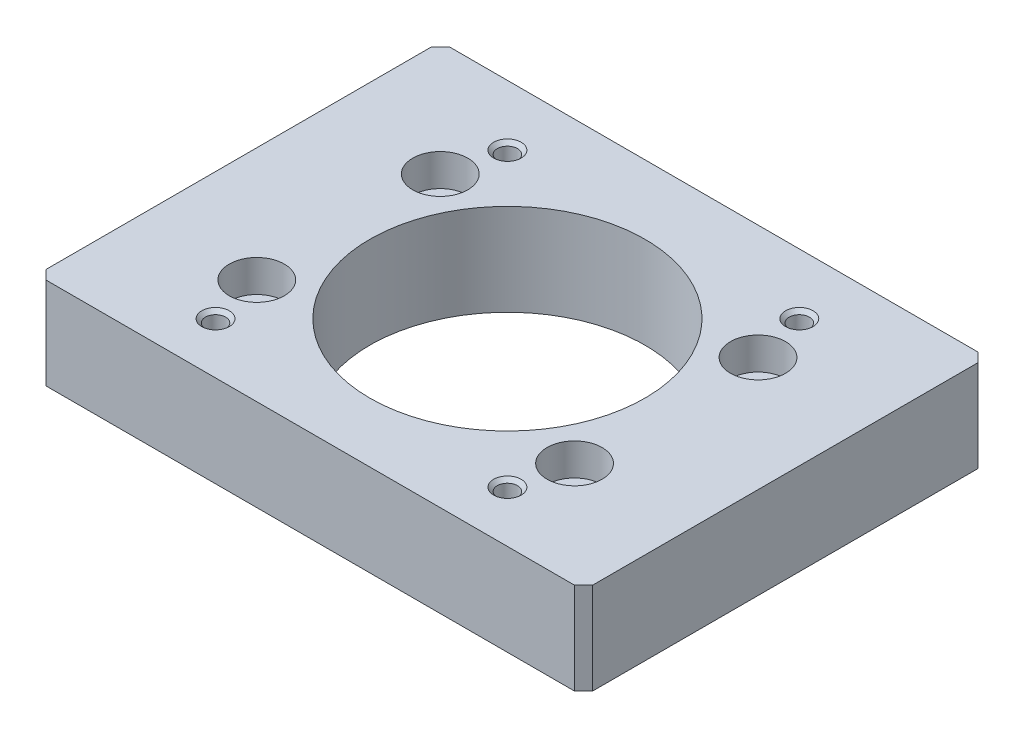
ISO-10303-21;
HEADER;
FILE_DESCRIPTION(('STEP AP214'),'2;1');
FILE_NAME('part.step','',(''),(''),'','','');
FILE_SCHEMA(('AUTOMOTIVE_DESIGN { 1 0 10303 214 1 1 1 1 }'));
ENDSEC;
DATA;
#1=APPLICATION_CONTEXT('core data for automotive mechanical design processes');
#2=APPLICATION_PROTOCOL_DEFINITION('international standard','automotive_design',2000,#1);
#3=PRODUCT_CONTEXT('',#1,'mechanical');
#4=PRODUCT('Part','Part','',(#3));
#5=PRODUCT_RELATED_PRODUCT_CATEGORY('part','',(#4));
#6=PRODUCT_DEFINITION_FORMATION('','',#4);
#7=PRODUCT_DEFINITION_CONTEXT('part definition',#1,'design');
#8=PRODUCT_DEFINITION('design','',#6,#7);
#9=PRODUCT_DEFINITION_SHAPE('','',#8);
#10=(LENGTH_UNIT() NAMED_UNIT(*) SI_UNIT(.MILLI.,.METRE.));
#11=(NAMED_UNIT(*) PLANE_ANGLE_UNIT() SI_UNIT($,.RADIAN.));
#12=(NAMED_UNIT(*) SI_UNIT($,.STERADIAN.) SOLID_ANGLE_UNIT());
#13=UNCERTAINTY_MEASURE_WITH_UNIT(LENGTH_MEASURE(1.E-05),#10,'distance_accuracy_value','');
#14=(GEOMETRIC_REPRESENTATION_CONTEXT(3) GLOBAL_UNCERTAINTY_ASSIGNED_CONTEXT((#13)) GLOBAL_UNIT_ASSIGNED_CONTEXT((#10,
#11,#12)) REPRESENTATION_CONTEXT('',''));
#15=CARTESIAN_POINT('',(0.,0.,0.));
#16=DIRECTION('',(0.,0.,1.));
#17=DIRECTION('',(1.,0.,0.));
#18=AXIS2_PLACEMENT_3D('',#15,#16,#17);
#19=CARTESIAN_POINT('',(-15.9099025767,9.60000000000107,-15.4099025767));
#20=DIRECTION('',(0.,1.,0.));
#21=DIRECTION('',(-1.,0.,0.));
#22=AXIS2_PLACEMENT_3D('',#19,#20,#21);
#23=CONICAL_SURFACE('',#22,1.09999999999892,0.785398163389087);
#24=CARTESIAN_POINT('',(-15.9099025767,9.6,-15.4099025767));
#25=DIRECTION('',(0.,1.,0.));
#26=DIRECTION('',(1.,0.,0.));
#27=AXIS2_PLACEMENT_3D('',#24,#25,#26);
#28=CIRCLE('',#27,1.1);
#29=CARTESIAN_POINT('',(-14.8099025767,9.6,-15.4099025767));
#30=VERTEX_POINT('',#29);
#31=EDGE_CURVE('E191',#30,#30,#28,.F.);
#32=ORIENTED_EDGE('',*,*,#31,.T.);
#33=EDGE_LOOP('',(#32));
#34=FACE_BOUND('',#33,.T.);
#35=CARTESIAN_POINT('',(-15.9099025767,10.0000000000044,-15.4099025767));
#36=DIRECTION('',(0.,1.,0.));
#37=DIRECTION('',(-1.,0.,0.));
#38=AXIS2_PLACEMENT_3D('',#35,#36,#37);
#39=CIRCLE('',#38,1.49999999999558);
#40=CARTESIAN_POINT('',(-17.4099025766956,10.0000000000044,-15.4099025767));
#41=VERTEX_POINT('',#40);
#42=EDGE_CURVE('E174',#41,#41,#39,.T.);
#43=ORIENTED_EDGE('',*,*,#42,.T.);
#44=EDGE_LOOP('',(#43));
#45=FACE_BOUND('',#44,.T.);
#46=ADVANCED_FACE('F16',(#34,#45),#23,.F.);
#47=CARTESIAN_POINT('',(15.9099025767,9.60000000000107,-15.4099025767));
#48=DIRECTION('',(0.,1.,0.));
#49=DIRECTION('',(0.,0.,1.));
#50=AXIS2_PLACEMENT_3D('',#47,#48,#49);
#51=CONICAL_SURFACE('',#50,1.09999999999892,0.785398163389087);
#52=CARTESIAN_POINT('',(15.9099025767,9.6,-15.4099025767));
#53=DIRECTION('',(0.,1.,0.));
#54=DIRECTION('',(1.,0.,0.));
#55=AXIS2_PLACEMENT_3D('',#52,#53,#54);
#56=CIRCLE('',#55,1.1);
#57=CARTESIAN_POINT('',(17.0099025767,9.6,-15.4099025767));
#58=VERTEX_POINT('',#57);
#59=EDGE_CURVE('E195',#58,#58,#56,.F.);
#60=ORIENTED_EDGE('',*,*,#59,.T.);
#61=EDGE_LOOP('',(#60));
#62=FACE_BOUND('',#61,.T.);
#63=CARTESIAN_POINT('',(15.9099025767,10.0000000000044,-15.4099025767));
#64=DIRECTION('',(0.,1.,0.));
#65=DIRECTION('',(0.,0.,1.));
#66=AXIS2_PLACEMENT_3D('',#63,#64,#65);
#67=CIRCLE('',#66,1.49999999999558);
#68=CARTESIAN_POINT('',(15.9099025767,10.0000000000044,-13.9099025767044));
#69=VERTEX_POINT('',#68);
#70=EDGE_CURVE('E171',#69,#69,#67,.T.);
#71=ORIENTED_EDGE('',*,*,#70,.T.);
#72=EDGE_LOOP('',(#71));
#73=FACE_BOUND('',#72,.T.);
#74=ADVANCED_FACE('F359',(#62,#73),#51,.F.);
#75=CARTESIAN_POINT('',(-15.9099025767,9.60000000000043,16.4099025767));
#76=DIRECTION('',(0.,1.,0.));
#77=DIRECTION('',(0.,0.,1.));
#78=AXIS2_PLACEMENT_3D('',#75,#76,#77);
#79=CONICAL_SURFACE('',#78,1.09999999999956,0.785398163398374);
#80=CARTESIAN_POINT('',(-15.9099025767,9.6,16.4099025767));
#81=DIRECTION('',(0.,1.,0.));
#82=DIRECTION('',(1.,0.,0.));
#83=AXIS2_PLACEMENT_3D('',#80,#81,#82);
#84=CIRCLE('',#83,1.1);
#85=CARTESIAN_POINT('',(-14.8099025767,9.6,16.4099025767));
#86=VERTEX_POINT('',#85);
#87=EDGE_CURVE('E208',#86,#86,#84,.F.);
#88=ORIENTED_EDGE('',*,*,#87,.T.);
#89=EDGE_LOOP('',(#88));
#90=FACE_BOUND('',#89,.T.);
#91=CARTESIAN_POINT('',(-15.9099025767,10.0000000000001,16.4099025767));
#92=DIRECTION('',(0.,1.,0.));
#93=DIRECTION('',(0.,0.,1.));
#94=AXIS2_PLACEMENT_3D('',#91,#92,#93);
#95=CIRCLE('',#94,1.49999999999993);
#96=CARTESIAN_POINT('',(-15.9099025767,10.0000000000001,17.9099025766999));
#97=VERTEX_POINT('',#96);
#98=EDGE_CURVE('E168',#97,#97,#95,.T.);
#99=ORIENTED_EDGE('',*,*,#98,.T.);
#100=EDGE_LOOP('',(#99));
#101=FACE_BOUND('',#100,.T.);
#102=ADVANCED_FACE('F355',(#90,#101),#79,.F.);
#103=CARTESIAN_POINT('',(15.9099025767,9.60000000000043,16.4099025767));
#104=DIRECTION('',(0.,1.,0.));
#105=DIRECTION('',(0.,0.,1.));
#106=AXIS2_PLACEMENT_3D('',#103,#104,#105);
#107=CONICAL_SURFACE('',#106,1.09999999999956,0.785398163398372);
#108=CARTESIAN_POINT('',(15.9099025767,9.6,16.4099025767));
#109=DIRECTION('',(0.,1.,0.));
#110=DIRECTION('',(1.,0.,0.));
#111=AXIS2_PLACEMENT_3D('',#108,#109,#110);
#112=CIRCLE('',#111,1.1);
#113=CARTESIAN_POINT('',(17.0099025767,9.6,16.4099025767));
#114=VERTEX_POINT('',#113);
#115=EDGE_CURVE('E200',#114,#114,#112,.F.);
#116=ORIENTED_EDGE('',*,*,#115,.T.);
#117=EDGE_LOOP('',(#116));
#118=FACE_BOUND('',#117,.T.);
#119=CARTESIAN_POINT('',(15.9099025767,10.0000000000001,16.4099025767));
#120=DIRECTION('',(0.,1.,0.));
#121=DIRECTION('',(0.,0.,1.));
#122=AXIS2_PLACEMENT_3D('',#119,#120,#121);
#123=CIRCLE('',#122,1.49999999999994);
#124=CARTESIAN_POINT('',(15.9099025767,10.0000000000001,17.9099025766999));
#125=VERTEX_POINT('',#124);
#126=EDGE_CURVE('E165',#125,#125,#123,.T.);
#127=ORIENTED_EDGE('',*,*,#126,.T.);
#128=EDGE_LOOP('',(#127));
#129=FACE_BOUND('',#128,.T.);
#130=ADVANCED_FACE('F352',(#118,#129),#107,.F.);
#131=CARTESIAN_POINT('',(17.32050807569,6.5,-9.5));
#132=DIRECTION('',(0.,1.,0.));
#133=DIRECTION('',(0.,0.,1.));
#134=AXIS2_PLACEMENT_3D('',#131,#132,#133);
#135=CYLINDRICAL_SURFACE('',#134,3.);
#136=CARTESIAN_POINT('',(17.32050807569,6.5,-9.5));
#137=DIRECTION('',(0.,1.,0.));
#138=DIRECTION('',(0.,0.,1.));
#139=AXIS2_PLACEMENT_3D('',#136,#137,#138);
#140=CIRCLE('',#139,3.);
#141=CARTESIAN_POINT('',(17.32050807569,6.5,-6.5));
#142=VERTEX_POINT('',#141);
#143=EDGE_CURVE('E20',#142,#142,#140,.F.);
#144=ORIENTED_EDGE('',*,*,#143,.T.);
#145=EDGE_LOOP('',(#144));
#146=FACE_BOUND('',#145,.T.);
#147=CARTESIAN_POINT('',(17.32050807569,10.,-9.5));
#148=DIRECTION('',(0.,1.,0.));
#149=DIRECTION('',(0.,0.,1.));
#150=AXIS2_PLACEMENT_3D('',#147,#148,#149);
#151=CIRCLE('',#150,3.);
#152=CARTESIAN_POINT('',(17.32050807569,10.,-6.5));
#153=VERTEX_POINT('',#152);
#154=EDGE_CURVE('E162',#153,#153,#151,.T.);
#155=ORIENTED_EDGE('',*,*,#154,.T.);
#156=EDGE_LOOP('',(#155));
#157=FACE_BOUND('',#156,.T.);
#158=ADVANCED_FACE('F348',(#146,#157),#135,.F.);
#159=CARTESIAN_POINT('',(-17.32050807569,6.5,-9.5));
#160=DIRECTION('',(0.,1.,0.));
#161=DIRECTION('',(0.,0.,1.));
#162=AXIS2_PLACEMENT_3D('',#159,#160,#161);
#163=CYLINDRICAL_SURFACE('',#162,3.);
#164=CARTESIAN_POINT('',(-17.32050807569,6.5,-9.5));
#165=DIRECTION('',(0.,1.,0.));
#166=DIRECTION('',(0.,0.,1.));
#167=AXIS2_PLACEMENT_3D('',#164,#165,#166);
#168=CIRCLE('',#167,3.);
#169=CARTESIAN_POINT('',(-17.32050807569,6.5,-6.5));
#170=VERTEX_POINT('',#169);
#171=EDGE_CURVE('E184',#170,#170,#168,.F.);
#172=ORIENTED_EDGE('',*,*,#171,.T.);
#173=EDGE_LOOP('',(#172));
#174=FACE_BOUND('',#173,.T.);
#175=CARTESIAN_POINT('',(-17.32050807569,10.,-9.5));
#176=DIRECTION('',(0.,1.,0.));
#177=DIRECTION('',(0.,0.,1.));
#178=AXIS2_PLACEMENT_3D('',#175,#176,#177);
#179=CIRCLE('',#178,3.);
#180=CARTESIAN_POINT('',(-17.32050807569,10.,-6.5));
#181=VERTEX_POINT('',#180);
#182=EDGE_CURVE('E159',#181,#181,#179,.T.);
#183=ORIENTED_EDGE('',*,*,#182,.T.);
#184=EDGE_LOOP('',(#183));
#185=FACE_BOUND('',#184,.T.);
#186=ADVANCED_FACE('F344',(#174,#185),#163,.F.);
#187=CARTESIAN_POINT('',(-17.32050807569,6.5,10.5));
#188=DIRECTION('',(0.,1.,0.));
#189=DIRECTION('',(0.,0.,1.));
#190=AXIS2_PLACEMENT_3D('',#187,#188,#189);
#191=CYLINDRICAL_SURFACE('',#190,3.);
#192=CARTESIAN_POINT('',(-17.32050807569,6.5,10.5));
#193=DIRECTION('',(0.,1.,0.));
#194=DIRECTION('',(0.,0.,1.));
#195=AXIS2_PLACEMENT_3D('',#192,#193,#194);
#196=CIRCLE('',#195,3.);
#197=CARTESIAN_POINT('',(-17.32050807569,6.5,13.5));
#198=VERTEX_POINT('',#197);
#199=EDGE_CURVE('E90',#198,#198,#196,.F.);
#200=ORIENTED_EDGE('',*,*,#199,.T.);
#201=EDGE_LOOP('',(#200));
#202=FACE_BOUND('',#201,.T.);
#203=CARTESIAN_POINT('',(-17.32050807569,10.,10.5));
#204=DIRECTION('',(0.,1.,0.));
#205=DIRECTION('',(0.,0.,1.));
#206=AXIS2_PLACEMENT_3D('',#203,#204,#205);
#207=CIRCLE('',#206,3.);
#208=CARTESIAN_POINT('',(-17.32050807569,10.,13.5));
#209=VERTEX_POINT('',#208);
#210=EDGE_CURVE('E107',#209,#209,#207,.T.);
#211=ORIENTED_EDGE('',*,*,#210,.T.);
#212=EDGE_LOOP('',(#211));
#213=FACE_BOUND('',#212,.T.);
#214=ADVANCED_FACE('F341',(#202,#213),#191,.F.);
#215=CARTESIAN_POINT('',(17.32050807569,6.5,10.5));
#216=DIRECTION('',(0.,1.,0.));
#217=DIRECTION('',(0.,0.,1.));
#218=AXIS2_PLACEMENT_3D('',#215,#216,#217);
#219=CYLINDRICAL_SURFACE('',#218,3.);
#220=CARTESIAN_POINT('',(17.32050807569,6.5,10.5));
#221=DIRECTION('',(0.,1.,0.));
#222=DIRECTION('',(0.,0.,1.));
#223=AXIS2_PLACEMENT_3D('',#220,#221,#222);
#224=CIRCLE('',#223,3.);
#225=CARTESIAN_POINT('',(17.32050807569,6.5,13.5));
#226=VERTEX_POINT('',#225);
#227=EDGE_CURVE('E186',#226,#226,#224,.F.);
#228=ORIENTED_EDGE('',*,*,#227,.T.);
#229=EDGE_LOOP('',(#228));
#230=FACE_BOUND('',#229,.T.);
#231=CARTESIAN_POINT('',(17.32050807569,10.,10.5));
#232=DIRECTION('',(0.,1.,0.));
#233=DIRECTION('',(0.,0.,1.));
#234=AXIS2_PLACEMENT_3D('',#231,#232,#233);
#235=CIRCLE('',#234,3.);
#236=CARTESIAN_POINT('',(17.32050807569,10.,13.5));
#237=VERTEX_POINT('',#236);
#238=EDGE_CURVE('E104',#237,#237,#235,.T.);
#239=ORIENTED_EDGE('',*,*,#238,.T.);
#240=EDGE_LOOP('',(#239));
#241=FACE_BOUND('',#240,.T.);
#242=ADVANCED_FACE('F338',(#230,#241),#219,.F.);
#243=CARTESIAN_POINT('',(-29.86914683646,10.2,-20.93085316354));
#244=DIRECTION('',(-0.707106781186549,0.,-0.707106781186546));
#245=DIRECTION('',(0.707106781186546,0.,-0.707106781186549));
#246=AXIS2_PLACEMENT_3D('',#243,#244,#245);
#247=PLANE('',#246);
#248=DIRECTION('',(0.707106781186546,0.,-0.707106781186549));
#249=VECTOR('',#248,1.);
#250=CARTESIAN_POINT('',(-29.86914683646,10.,-20.93085316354));
#251=LINE('',#250,#249);
#252=CARTESIAN_POINT('',(-29.8,10.,-21.));
#253=VERTEX_POINT('',#252);
#254=CARTESIAN_POINT('',(-28.8,10.,-22.));
#255=VERTEX_POINT('',#254);
#256=EDGE_CURVE('E177',#253,#255,#251,.T.);
#257=ORIENTED_EDGE('',*,*,#256,.T.);
#258=DIRECTION('',(0.,1.,0.));
#259=VECTOR('',#258,1.);
#260=CARTESIAN_POINT('',(-28.8,5.,-22.));
#261=LINE('',#260,#259);
#262=CARTESIAN_POINT('',(-28.8,0.,-22.));
#263=VERTEX_POINT('',#262);
#264=EDGE_CURVE('E100',#255,#263,#261,.F.);
#265=ORIENTED_EDGE('',*,*,#264,.T.);
#266=DIRECTION('',(-0.707106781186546,0.,0.707106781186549));
#267=VECTOR('',#266,1.);
#268=CARTESIAN_POINT('',(-29.3,0.,-21.5));
#269=LINE('',#268,#267);
#270=CARTESIAN_POINT('',(-29.8,0.,-21.));
#271=VERTEX_POINT('',#270);
#272=EDGE_CURVE('E203',#271,#263,#269,.F.);
#273=ORIENTED_EDGE('',*,*,#272,.F.);
#274=DIRECTION('',(0.,-1.,0.));
#275=VECTOR('',#274,1.);
#276=CARTESIAN_POINT('',(-29.8,5.,-21.));
#277=LINE('',#276,#275);
#278=EDGE_CURVE('E215',#271,#253,#277,.F.);
#279=ORIENTED_EDGE('',*,*,#278,.T.);
#280=EDGE_LOOP('',(#257,#265,#273,#279));
#281=FACE_BOUND('',#280,.T.);
#282=ADVANCED_FACE('F261',(#281),#247,.T.);
#283=CARTESIAN_POINT('',(-28.73085316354,10.2,22.06914683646));
#284=DIRECTION('',(-0.707106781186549,0.,0.707106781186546));
#285=DIRECTION('',(-0.707106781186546,0.,-0.707106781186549));
#286=AXIS2_PLACEMENT_3D('',#283,#284,#285);
#287=PLANE('',#286);
#288=DIRECTION('',(-0.707106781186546,0.,-0.707106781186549));
#289=VECTOR('',#288,1.);
#290=CARTESIAN_POINT('',(-28.73085316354,10.,22.06914683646));
#291=LINE('',#290,#289);
#292=CARTESIAN_POINT('',(-28.8,10.,22.));
#293=VERTEX_POINT('',#292);
#294=CARTESIAN_POINT('',(-29.8,10.,21.));
#295=VERTEX_POINT('',#294);
#296=EDGE_CURVE('E179',#293,#295,#291,.T.);
#297=ORIENTED_EDGE('',*,*,#296,.T.);
#298=DIRECTION('',(0.,1.,0.));
#299=VECTOR('',#298,1.);
#300=CARTESIAN_POINT('',(-29.8,5.,21.));
#301=LINE('',#300,#299);
#302=CARTESIAN_POINT('',(-29.8,0.,21.));
#303=VERTEX_POINT('',#302);
#304=EDGE_CURVE('E214',#295,#303,#301,.F.);
#305=ORIENTED_EDGE('',*,*,#304,.T.);
#306=DIRECTION('',(0.707106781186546,0.,0.707106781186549));
#307=VECTOR('',#306,1.);
#308=CARTESIAN_POINT('',(-29.3,0.,21.5));
#309=LINE('',#308,#307);
#310=CARTESIAN_POINT('',(-28.8,0.,22.));
#311=VERTEX_POINT('',#310);
#312=EDGE_CURVE('E257',#311,#303,#309,.F.);
#313=ORIENTED_EDGE('',*,*,#312,.F.);
#314=DIRECTION('',(0.,-1.,0.));
#315=VECTOR('',#314,1.);
#316=CARTESIAN_POINT('',(-28.8,5.,22.));
#317=LINE('',#316,#315);
#318=EDGE_CURVE('E222',#311,#293,#317,.F.);
#319=ORIENTED_EDGE('',*,*,#318,.T.);
#320=EDGE_LOOP('',(#297,#305,#313,#319));
#321=FACE_BOUND('',#320,.T.);
#322=ADVANCED_FACE('F267',(#321),#287,.T.);
#323=CARTESIAN_POINT('',(28.73085316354,10.2,-22.06914683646));
#324=DIRECTION('',(0.707106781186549,0.,-0.707106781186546));
#325=DIRECTION('',(0.707106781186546,0.,0.707106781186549));
#326=AXIS2_PLACEMENT_3D('',#323,#324,#325);
#327=PLANE('',#326);
#328=DIRECTION('',(0.707106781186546,0.,0.707106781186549));
#329=VECTOR('',#328,1.);
#330=CARTESIAN_POINT('',(28.73085316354,10.,-22.06914683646));
#331=LINE('',#330,#329);
#332=CARTESIAN_POINT('',(28.8,10.,-22.));
#333=VERTEX_POINT('',#332);
#334=CARTESIAN_POINT('',(29.8,10.,-21.));
#335=VERTEX_POINT('',#334);
#336=EDGE_CURVE('E80',#333,#335,#331,.T.);
#337=ORIENTED_EDGE('',*,*,#336,.T.);
#338=DIRECTION('',(0.,1.,0.));
#339=VECTOR('',#338,1.);
#340=CARTESIAN_POINT('',(29.8,5.,-21.));
#341=LINE('',#340,#339);
#342=CARTESIAN_POINT('',(29.8,0.,-21.));
#343=VERTEX_POINT('',#342);
#344=EDGE_CURVE('E113',#335,#343,#341,.F.);
#345=ORIENTED_EDGE('',*,*,#344,.T.);
#346=DIRECTION('',(-0.707106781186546,0.,-0.707106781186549));
#347=VECTOR('',#346,1.);
#348=CARTESIAN_POINT('',(29.3,0.,-21.5));
#349=LINE('',#348,#347);
#350=CARTESIAN_POINT('',(28.8,0.,-22.));
#351=VERTEX_POINT('',#350);
#352=EDGE_CURVE('E103',#351,#343,#349,.F.);
#353=ORIENTED_EDGE('',*,*,#352,.F.);
#354=DIRECTION('',(0.,-1.,0.));
#355=VECTOR('',#354,1.);
#356=CARTESIAN_POINT('',(28.8,5.,-22.));
#357=LINE('',#356,#355);
#358=EDGE_CURVE('E97',#351,#333,#357,.F.);
#359=ORIENTED_EDGE('',*,*,#358,.T.);
#360=EDGE_LOOP('',(#337,#345,#353,#359));
#361=FACE_BOUND('',#360,.T.);
#362=ADVANCED_FACE('F102',(#361),#327,.T.);
#363=CARTESIAN_POINT('',(29.86914683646,10.2,20.93085316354));
#364=DIRECTION('',(0.707106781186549,0.,0.707106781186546));
#365=DIRECTION('',(-0.707106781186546,0.,0.707106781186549));
#366=AXIS2_PLACEMENT_3D('',#363,#364,#365);
#367=PLANE('',#366);
#368=DIRECTION('',(-0.707106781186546,0.,0.707106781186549));
#369=VECTOR('',#368,1.);
#370=CARTESIAN_POINT('',(29.86914683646,10.,20.93085316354));
#371=LINE('',#370,#369);
#372=CARTESIAN_POINT('',(29.8,10.,21.));
#373=VERTEX_POINT('',#372);
#374=CARTESIAN_POINT('',(28.8,10.,22.));
#375=VERTEX_POINT('',#374);
#376=EDGE_CURVE('E89',#373,#375,#371,.T.);
#377=ORIENTED_EDGE('',*,*,#376,.T.);
#378=DIRECTION('',(0.,1.,0.));
#379=VECTOR('',#378,1.);
#380=CARTESIAN_POINT('',(28.8,5.,22.));
#381=LINE('',#380,#379);
#382=CARTESIAN_POINT('',(28.8,0.,22.));
#383=VERTEX_POINT('',#382);
#384=EDGE_CURVE('E111',#375,#383,#381,.F.);
#385=ORIENTED_EDGE('',*,*,#384,.T.);
#386=DIRECTION('',(0.707106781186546,0.,-0.707106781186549));
#387=VECTOR('',#386,1.);
#388=CARTESIAN_POINT('',(29.3,0.,21.5));
#389=LINE('',#388,#387);
#390=CARTESIAN_POINT('',(29.8,0.,21.));
#391=VERTEX_POINT('',#390);
#392=EDGE_CURVE('E35',#391,#383,#389,.F.);
#393=ORIENTED_EDGE('',*,*,#392,.F.);
#394=DIRECTION('',(0.,-1.,0.));
#395=VECTOR('',#394,1.);
#396=CARTESIAN_POINT('',(29.8,5.,21.));
#397=LINE('',#396,#395);
#398=EDGE_CURVE('E114',#391,#373,#397,.F.);
#399=ORIENTED_EDGE('',*,*,#398,.T.);
#400=EDGE_LOOP('',(#377,#385,#393,#399));
#401=FACE_BOUND('',#400,.T.);
#402=ADVANCED_FACE('F228',(#401),#367,.T.);
#403=CARTESIAN_POINT('',(-15.9099025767,0.399999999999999,16.4099025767));
#404=DIRECTION('',(0.,1.,0.));
#405=DIRECTION('',(0.,0.,1.));
#406=AXIS2_PLACEMENT_3D('',#403,#404,#405);
#407=CYLINDRICAL_SURFACE('',#406,1.1);
#408=CARTESIAN_POINT('',(-15.9099025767,0.39999999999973,16.4099025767));
#409=DIRECTION('',(0.,-1.,0.));
#410=DIRECTION('',(0.,0.,-1.));
#411=AXIS2_PLACEMENT_3D('',#408,#409,#410);
#412=CIRCLE('',#411,1.09999999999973);
#413=CARTESIAN_POINT('',(-15.9099025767,0.39999999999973,15.3099025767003));
#414=VERTEX_POINT('',#413);
#415=EDGE_CURVE('E227',#414,#414,#412,.T.);
#416=ORIENTED_EDGE('',*,*,#415,.T.);
#417=EDGE_LOOP('',(#416));
#418=FACE_BOUND('',#417,.T.);
#419=ORIENTED_EDGE('',*,*,#87,.F.);
#420=EDGE_LOOP('',(#419));
#421=FACE_BOUND('',#420,.T.);
#422=ADVANCED_FACE('F333',(#418,#421),#407,.F.);
#423=CARTESIAN_POINT('',(15.9099025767,0.399999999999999,16.4099025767));
#424=DIRECTION('',(0.,1.,0.));
#425=DIRECTION('',(0.,0.,1.));
#426=AXIS2_PLACEMENT_3D('',#423,#424,#425);
#427=CYLINDRICAL_SURFACE('',#426,1.1);
#428=CARTESIAN_POINT('',(15.9099025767,0.39999999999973,16.4099025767));
#429=DIRECTION('',(0.,-1.,0.));
#430=DIRECTION('',(0.,0.,-1.));
#431=AXIS2_PLACEMENT_3D('',#428,#429,#430);
#432=CIRCLE('',#431,1.09999999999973);
#433=CARTESIAN_POINT('',(15.9099025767,0.39999999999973,15.3099025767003));
#434=VERTEX_POINT('',#433);
#435=EDGE_CURVE('E251',#434,#434,#432,.T.);
#436=ORIENTED_EDGE('',*,*,#435,.T.);
#437=EDGE_LOOP('',(#436));
#438=FACE_BOUND('',#437,.T.);
#439=ORIENTED_EDGE('',*,*,#115,.F.);
#440=EDGE_LOOP('',(#439));
#441=FACE_BOUND('',#440,.T.);
#442=ADVANCED_FACE('F329',(#438,#441),#427,.F.);
#443=CARTESIAN_POINT('',(15.9099025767,0.399999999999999,-15.4099025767));
#444=DIRECTION('',(0.,1.,0.));
#445=DIRECTION('',(0.,0.,1.));
#446=AXIS2_PLACEMENT_3D('',#443,#444,#445);
#447=CYLINDRICAL_SURFACE('',#446,1.1);
#448=CARTESIAN_POINT('',(15.9099025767,0.399999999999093,-15.4099025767));
#449=DIRECTION('',(0.,-1.,0.));
#450=DIRECTION('',(0.,0.,-1.));
#451=AXIS2_PLACEMENT_3D('',#448,#449,#450);
#452=CIRCLE('',#451,1.09999999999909);
#453=CARTESIAN_POINT('',(15.9099025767,0.399999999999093,-16.5099025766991));
#454=VERTEX_POINT('',#453);
#455=EDGE_CURVE('E248',#454,#454,#452,.T.);
#456=ORIENTED_EDGE('',*,*,#455,.T.);
#457=EDGE_LOOP('',(#456));
#458=FACE_BOUND('',#457,.T.);
#459=ORIENTED_EDGE('',*,*,#59,.F.);
#460=EDGE_LOOP('',(#459));
#461=FACE_BOUND('',#460,.T.);
#462=ADVANCED_FACE('F325',(#458,#461),#447,.F.);
#463=CARTESIAN_POINT('',(-15.9099025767,0.399999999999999,-15.4099025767));
#464=DIRECTION('',(0.,1.,0.));
#465=DIRECTION('',(0.,0.,1.));
#466=AXIS2_PLACEMENT_3D('',#463,#464,#465);
#467=CYLINDRICAL_SURFACE('',#466,1.1);
#468=CARTESIAN_POINT('',(-15.9099025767,0.399999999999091,-15.4099025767));
#469=DIRECTION('',(0.,-1.,0.));
#470=DIRECTION('',(0.,0.,-1.));
#471=AXIS2_PLACEMENT_3D('',#468,#469,#470);
#472=CIRCLE('',#471,1.09999999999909);
#473=CARTESIAN_POINT('',(-15.9099025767,0.399999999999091,-16.5099025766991));
#474=VERTEX_POINT('',#473);
#475=EDGE_CURVE('E155',#474,#474,#472,.T.);
#476=ORIENTED_EDGE('',*,*,#475,.T.);
#477=EDGE_LOOP('',(#476));
#478=FACE_BOUND('',#477,.T.);
#479=ORIENTED_EDGE('',*,*,#31,.F.);
#480=EDGE_LOOP('',(#479));
#481=FACE_BOUND('',#480,.T.);
#482=ADVANCED_FACE('F321',(#478,#481),#467,.F.);
#483=CARTESIAN_POINT('',(-21.13332839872,6.5,14.02650185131));
#484=DIRECTION('',(0.,1.,0.));
#485=DIRECTION('',(1.,0.,0.));
#486=AXIS2_PLACEMENT_3D('',#483,#484,#485);
#487=PLANE('',#486);
#488=CARTESIAN_POINT('',(17.32050807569,6.5,-9.5));
#489=DIRECTION('',(0.,1.,0.));
#490=DIRECTION('',(0.,0.,1.));
#491=AXIS2_PLACEMENT_3D('',#488,#489,#490);
#492=CIRCLE('',#491,1.74999999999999);
#493=CARTESIAN_POINT('',(17.32050807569,6.5,-7.75000000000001));
#494=VERTEX_POINT('',#493);
#495=EDGE_CURVE('E153',#494,#494,#492,.F.);
#496=ORIENTED_EDGE('',*,*,#495,.T.);
#497=EDGE_LOOP('',(#496));
#498=FACE_BOUND('',#497,.T.);
#499=ORIENTED_EDGE('',*,*,#143,.F.);
#500=EDGE_LOOP('',(#499));
#501=FACE_BOUND('',#500,.T.);
#502=ADVANCED_FACE('F324',(#498,#501),#487,.T.);
#503=CARTESIAN_POINT('',(-21.13332839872,6.5,14.02650185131));
#504=DIRECTION('',(0.,1.,0.));
#505=DIRECTION('',(1.,0.,0.));
#506=AXIS2_PLACEMENT_3D('',#503,#504,#505);
#507=PLANE('',#506);
#508=CARTESIAN_POINT('',(17.32050807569,6.5,10.5));
#509=DIRECTION('',(0.,1.,0.));
#510=DIRECTION('',(0.,0.,1.));
#511=AXIS2_PLACEMENT_3D('',#508,#509,#510);
#512=CIRCLE('',#511,1.74999999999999);
#513=CARTESIAN_POINT('',(17.32050807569,6.5,12.25));
#514=VERTEX_POINT('',#513);
#515=EDGE_CURVE('E150',#514,#514,#512,.F.);
#516=ORIENTED_EDGE('',*,*,#515,.T.);
#517=EDGE_LOOP('',(#516));
#518=FACE_BOUND('',#517,.T.);
#519=ORIENTED_EDGE('',*,*,#227,.F.);
#520=EDGE_LOOP('',(#519));
#521=FACE_BOUND('',#520,.T.);
#522=ADVANCED_FACE('F376',(#518,#521),#507,.T.);
#523=CARTESIAN_POINT('',(-21.13332839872,6.5,14.02650185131));
#524=DIRECTION('',(0.,1.,0.));
#525=DIRECTION('',(1.,0.,0.));
#526=AXIS2_PLACEMENT_3D('',#523,#524,#525);
#527=PLANE('',#526);
#528=CARTESIAN_POINT('',(-17.32050807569,6.5,-9.5));
#529=DIRECTION('',(0.,1.,0.));
#530=DIRECTION('',(0.,0.,1.));
#531=AXIS2_PLACEMENT_3D('',#528,#529,#530);
#532=CIRCLE('',#531,1.75);
#533=CARTESIAN_POINT('',(-17.32050807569,6.5,-7.75));
#534=VERTEX_POINT('',#533);
#535=EDGE_CURVE('E147',#534,#534,#532,.F.);
#536=ORIENTED_EDGE('',*,*,#535,.T.);
#537=EDGE_LOOP('',(#536));
#538=FACE_BOUND('',#537,.T.);
#539=ORIENTED_EDGE('',*,*,#171,.F.);
#540=EDGE_LOOP('',(#539));
#541=FACE_BOUND('',#540,.T.);
#542=ADVANCED_FACE('F380',(#538,#541),#527,.T.);
#543=CARTESIAN_POINT('',(-21.13332839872,6.5,14.02650185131));
#544=DIRECTION('',(0.,1.,0.));
#545=DIRECTION('',(1.,0.,0.));
#546=AXIS2_PLACEMENT_3D('',#543,#544,#545);
#547=PLANE('',#546);
#548=CARTESIAN_POINT('',(-17.32050807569,6.5,10.5));
#549=DIRECTION('',(0.,1.,0.));
#550=DIRECTION('',(0.,0.,1.));
#551=AXIS2_PLACEMENT_3D('',#548,#549,#550);
#552=CIRCLE('',#551,1.75);
#553=CARTESIAN_POINT('',(-17.32050807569,6.5,12.25));
#554=VERTEX_POINT('',#553);
#555=EDGE_CURVE('E144',#554,#554,#552,.F.);
#556=ORIENTED_EDGE('',*,*,#555,.T.);
#557=EDGE_LOOP('',(#556));
#558=FACE_BOUND('',#557,.T.);
#559=ORIENTED_EDGE('',*,*,#199,.F.);
#560=EDGE_LOOP('',(#559));
#561=FACE_BOUND('',#560,.T.);
#562=ADVANCED_FACE('F384',(#558,#561),#547,.T.);
#563=CARTESIAN_POINT('',(-30.992,10.,22.88));
#564=DIRECTION('',(0.,1.,0.));
#565=DIRECTION('',(1.,0.,0.));
#566=AXIS2_PLACEMENT_3D('',#563,#564,#565);
#567=PLANE('',#566);
#568=CARTESIAN_POINT('',(0.,10.,0.5));
#569=DIRECTION('',(0.,1.,0.));
#570=DIRECTION('',(0.,0.,1.));
#571=AXIS2_PLACEMENT_3D('',#568,#569,#570);
#572=CIRCLE('',#571,15.);
#573=CARTESIAN_POINT('',(0.,10.,15.5));
#574=VERTEX_POINT('',#573);
#575=EDGE_CURVE('E140',#574,#574,#572,.F.);
#576=ORIENTED_EDGE('',*,*,#575,.T.);
#577=EDGE_LOOP('',(#576));
#578=FACE_BOUND('',#577,.T.);
#579=ORIENTED_EDGE('',*,*,#238,.F.);
#580=EDGE_LOOP('',(#579));
#581=FACE_BOUND('',#580,.T.);
#582=ORIENTED_EDGE('',*,*,#210,.F.);
#583=EDGE_LOOP('',(#582));
#584=FACE_BOUND('',#583,.T.);
#585=ORIENTED_EDGE('',*,*,#182,.F.);
#586=EDGE_LOOP('',(#585));
#587=FACE_BOUND('',#586,.T.);
#588=ORIENTED_EDGE('',*,*,#154,.F.);
#589=EDGE_LOOP('',(#588));
#590=FACE_BOUND('',#589,.T.);
#591=ORIENTED_EDGE('',*,*,#126,.F.);
#592=EDGE_LOOP('',(#591));
#593=FACE_BOUND('',#592,.T.);
#594=ORIENTED_EDGE('',*,*,#98,.F.);
#595=EDGE_LOOP('',(#594));
#596=FACE_BOUND('',#595,.T.);
#597=ORIENTED_EDGE('',*,*,#70,.F.);
#598=EDGE_LOOP('',(#597));
#599=FACE_BOUND('',#598,.T.);
#600=ORIENTED_EDGE('',*,*,#42,.F.);
#601=EDGE_LOOP('',(#600));
#602=FACE_BOUND('',#601,.T.);
#603=ORIENTED_EDGE('',*,*,#256,.F.);
#604=DIRECTION('',(0.,0.,-1.));
#605=VECTOR('',#604,1.);
#606=CARTESIAN_POINT('',(-29.8,9.99999999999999,0.));
#607=LINE('',#606,#605);
#608=EDGE_CURVE('E211',#253,#295,#607,.F.);
#609=ORIENTED_EDGE('',*,*,#608,.T.);
#610=ORIENTED_EDGE('',*,*,#296,.F.);
#611=DIRECTION('',(-1.,0.,0.));
#612=VECTOR('',#611,1.);
#613=CARTESIAN_POINT('',(0.,10.,22.));
#614=LINE('',#613,#612);
#615=EDGE_CURVE('E219',#293,#375,#614,.F.);
#616=ORIENTED_EDGE('',*,*,#615,.T.);
#617=ORIENTED_EDGE('',*,*,#376,.F.);
#618=DIRECTION('',(0.,0.,1.));
#619=VECTOR('',#618,1.);
#620=CARTESIAN_POINT('',(29.8,9.99999999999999,0.));
#621=LINE('',#620,#619);
#622=EDGE_CURVE('E85',#373,#335,#621,.F.);
#623=ORIENTED_EDGE('',*,*,#622,.T.);
#624=ORIENTED_EDGE('',*,*,#336,.F.);
#625=DIRECTION('',(1.,0.,0.));
#626=VECTOR('',#625,1.);
#627=CARTESIAN_POINT('',(0.,10.,-22.));
#628=LINE('',#627,#626);
#629=EDGE_CURVE('E83',#333,#255,#628,.F.);
#630=ORIENTED_EDGE('',*,*,#629,.T.);
#631=EDGE_LOOP('',(#603,#609,#610,#616,#617,#623,#624,#630));
#632=FACE_BOUND('',#631,.T.);
#633=ADVANCED_FACE('F82',(#578,#581,#584,#587,#590,#593,#596,#599,#602,#632),#567,.T.);
#634=CARTESIAN_POINT('',(29.952,-0.2,-22.));
#635=DIRECTION('',(0.,0.,-1.));
#636=DIRECTION('',(-1.,0.,0.));
#637=AXIS2_PLACEMENT_3D('',#634,#635,#636);
#638=PLANE('',#637);
#639=ORIENTED_EDGE('',*,*,#264,.F.);
#640=ORIENTED_EDGE('',*,*,#629,.F.);
#641=ORIENTED_EDGE('',*,*,#358,.F.);
#642=DIRECTION('',(-1.,0.,0.));
#643=VECTOR('',#642,1.);
#644=CARTESIAN_POINT('',(0.,0.,-22.));
#645=LINE('',#644,#643);
#646=EDGE_CURVE('E143',#351,#263,#645,.T.);
#647=ORIENTED_EDGE('',*,*,#646,.T.);
#648=EDGE_LOOP('',(#639,#640,#641,#647));
#649=FACE_BOUND('',#648,.T.);
#650=ADVANCED_FACE('F95',(#649),#638,.T.);
#651=CARTESIAN_POINT('',(-29.8,-0.2,-21.84));
#652=DIRECTION('',(-1.,0.,0.));
#653=DIRECTION('',(0.,0.,1.));
#654=AXIS2_PLACEMENT_3D('',#651,#652,#653);
#655=PLANE('',#654);
#656=ORIENTED_EDGE('',*,*,#304,.F.);
#657=ORIENTED_EDGE('',*,*,#608,.F.);
#658=ORIENTED_EDGE('',*,*,#278,.F.);
#659=DIRECTION('',(0.,0.,1.));
#660=VECTOR('',#659,1.);
#661=CARTESIAN_POINT('',(-29.8,0.,0.));
#662=LINE('',#661,#660);
#663=EDGE_CURVE('E240',#271,#303,#662,.T.);
#664=ORIENTED_EDGE('',*,*,#663,.T.);
#665=EDGE_LOOP('',(#656,#657,#658,#664));
#666=FACE_BOUND('',#665,.T.);
#667=ADVANCED_FACE('F265',(#666),#655,.T.);
#668=CARTESIAN_POINT('',(-29.952,-0.2,22.));
#669=DIRECTION('',(0.,0.,1.));
#670=DIRECTION('',(1.,0.,0.));
#671=AXIS2_PLACEMENT_3D('',#668,#669,#670);
#672=PLANE('',#671);
#673=ORIENTED_EDGE('',*,*,#384,.F.);
#674=ORIENTED_EDGE('',*,*,#615,.F.);
#675=ORIENTED_EDGE('',*,*,#318,.F.);
#676=DIRECTION('',(1.,0.,0.));
#677=VECTOR('',#676,1.);
#678=CARTESIAN_POINT('',(0.,0.,22.));
#679=LINE('',#678,#677);
#680=EDGE_CURVE('E237',#311,#383,#679,.T.);
#681=ORIENTED_EDGE('',*,*,#680,.T.);
#682=EDGE_LOOP('',(#673,#674,#675,#681));
#683=FACE_BOUND('',#682,.T.);
#684=ADVANCED_FACE('F271',(#683),#672,.T.);
#685=CARTESIAN_POINT('',(29.8,-0.2,21.84));
#686=DIRECTION('',(1.,0.,0.));
#687=DIRECTION('',(0.,0.,-1.));
#688=AXIS2_PLACEMENT_3D('',#685,#686,#687);
#689=PLANE('',#688);
#690=ORIENTED_EDGE('',*,*,#398,.F.);
#691=DIRECTION('',(0.,0.,-1.));
#692=VECTOR('',#691,1.);
#693=CARTESIAN_POINT('',(29.8,0.,0.));
#694=LINE('',#693,#692);
#695=EDGE_CURVE('E139',#391,#343,#694,.T.);
#696=ORIENTED_EDGE('',*,*,#695,.T.);
#697=ORIENTED_EDGE('',*,*,#344,.F.);
#698=ORIENTED_EDGE('',*,*,#622,.F.);
#699=EDGE_LOOP('',(#690,#696,#697,#698));
#700=FACE_BOUND('',#699,.T.);
#701=ADVANCED_FACE('F233',(#700),#689,.T.);
#702=CARTESIAN_POINT('',(-15.9099025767,0.39999999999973,16.4099025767));
#703=DIRECTION('',(0.,-1.,0.));
#704=DIRECTION('',(1.,0.,0.));
#705=AXIS2_PLACEMENT_3D('',#702,#703,#704);
#706=CONICAL_SURFACE('',#705,1.09999999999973,0.785398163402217);
#707=ORIENTED_EDGE('',*,*,#415,.F.);
#708=EDGE_LOOP('',(#707));
#709=FACE_BOUND('',#708,.T.);
#710=CARTESIAN_POINT('',(-15.9099025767,1.63367583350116E-12,16.4099025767));
#711=DIRECTION('',(0.,-1.,0.));
#712=DIRECTION('',(1.,0.,0.));
#713=AXIS2_PLACEMENT_3D('',#710,#711,#712);
#714=CIRCLE('',#713,1.50000000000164);
#715=CARTESIAN_POINT('',(-14.4099025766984,1.63363887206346E-12,16.4099025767));
#716=VERTEX_POINT('',#715);
#717=EDGE_CURVE('E136',#716,#716,#714,.T.);
#718=ORIENTED_EDGE('',*,*,#717,.T.);
#719=EDGE_LOOP('',(#718));
#720=FACE_BOUND('',#719,.T.);
#721=ADVANCED_FACE('F279',(#709,#720),#706,.F.);
#722=CARTESIAN_POINT('',(15.9099025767,0.39999999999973,16.4099025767));
#723=DIRECTION('',(0.,-1.,0.));
#724=DIRECTION('',(1.,0.,0.));
#725=AXIS2_PLACEMENT_3D('',#722,#723,#724);
#726=CONICAL_SURFACE('',#725,1.09999999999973,0.785398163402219);
#727=ORIENTED_EDGE('',*,*,#435,.F.);
#728=EDGE_LOOP('',(#727));
#729=FACE_BOUND('',#728,.T.);
#730=CARTESIAN_POINT('',(15.9099025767,1.63833790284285E-12,16.4099025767));
#731=DIRECTION('',(0.,-1.,0.));
#732=DIRECTION('',(1.,0.,0.));
#733=AXIS2_PLACEMENT_3D('',#730,#731,#732);
#734=CIRCLE('',#733,1.50000000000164);
#735=CARTESIAN_POINT('',(17.4099025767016,1.63830094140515E-12,16.4099025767));
#736=VERTEX_POINT('',#735);
#737=EDGE_CURVE('E133',#736,#736,#734,.T.);
#738=ORIENTED_EDGE('',*,*,#737,.T.);
#739=EDGE_LOOP('',(#738));
#740=FACE_BOUND('',#739,.T.);
#741=ADVANCED_FACE('F309',(#729,#740),#726,.F.);
#742=CARTESIAN_POINT('',(15.9099025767,0.399999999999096,-15.4099025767));
#743=DIRECTION('',(0.,-1.,0.));
#744=DIRECTION('',(0.,0.,-1.));
#745=AXIS2_PLACEMENT_3D('',#742,#743,#744);
#746=CONICAL_SURFACE('',#745,1.09999999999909,0.78539816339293);
#747=ORIENTED_EDGE('',*,*,#455,.F.);
#748=EDGE_LOOP('',(#747));
#749=FACE_BOUND('',#748,.T.);
#750=CARTESIAN_POINT('',(15.9099025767,-2.71614328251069E-12,-15.4099025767));
#751=DIRECTION('',(0.,-1.,0.));
#752=DIRECTION('',(0.,0.,-1.));
#753=AXIS2_PLACEMENT_3D('',#750,#751,#752);
#754=CIRCLE('',#753,1.49999999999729);
#755=CARTESIAN_POINT('',(15.9099025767,-2.71614328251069E-12,-16.9099025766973));
#756=VERTEX_POINT('',#755);
#757=EDGE_CURVE('E130',#756,#756,#754,.T.);
#758=ORIENTED_EDGE('',*,*,#757,.T.);
#759=EDGE_LOOP('',(#758));
#760=FACE_BOUND('',#759,.T.);
#761=ADVANCED_FACE('F315',(#749,#760),#746,.F.);
#762=CARTESIAN_POINT('',(-15.9099025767,0.399999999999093,-15.4099025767));
#763=DIRECTION('',(0.,-1.,0.));
#764=DIRECTION('',(0.,0.,-1.));
#765=AXIS2_PLACEMENT_3D('',#762,#763,#764);
#766=CONICAL_SURFACE('',#765,1.09999999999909,0.785398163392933);
#767=ORIENTED_EDGE('',*,*,#475,.F.);
#768=EDGE_LOOP('',(#767));
#769=FACE_BOUND('',#768,.T.);
#770=CARTESIAN_POINT('',(-15.9099025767,-2.7152759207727E-12,-15.4099025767));
#771=DIRECTION('',(0.,-1.,0.));
#772=DIRECTION('',(0.,0.,-1.));
#773=AXIS2_PLACEMENT_3D('',#770,#771,#772);
#774=CIRCLE('',#773,1.49999999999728);
#775=CARTESIAN_POINT('',(-15.9099025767,-2.7152759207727E-12,-16.9099025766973));
#776=VERTEX_POINT('',#775);
#777=EDGE_CURVE('E127',#776,#776,#774,.T.);
#778=ORIENTED_EDGE('',*,*,#777,.T.);
#779=EDGE_LOOP('',(#778));
#780=FACE_BOUND('',#779,.T.);
#781=ADVANCED_FACE('F435',(#769,#780),#766,.F.);
#782=CARTESIAN_POINT('',(17.32050807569,0.,-9.5));
#783=DIRECTION('',(0.,1.,0.));
#784=DIRECTION('',(0.,0.,1.));
#785=AXIS2_PLACEMENT_3D('',#782,#783,#784);
#786=CYLINDRICAL_SURFACE('',#785,1.74999999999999);
#787=CARTESIAN_POINT('',(17.32050807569,0.,-9.5));
#788=DIRECTION('',(0.,1.,0.));
#789=DIRECTION('',(0.,0.,1.));
#790=AXIS2_PLACEMENT_3D('',#787,#788,#789);
#791=CIRCLE('',#790,1.74999999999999);
#792=CARTESIAN_POINT('',(17.32050807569,0.,-7.75000000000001));
#793=VERTEX_POINT('',#792);
#794=EDGE_CURVE('E124',#793,#793,#791,.F.);
#795=ORIENTED_EDGE('',*,*,#794,.T.);
#796=EDGE_LOOP('',(#795));
#797=FACE_BOUND('',#796,.T.);
#798=ORIENTED_EDGE('',*,*,#495,.F.);
#799=EDGE_LOOP('',(#798));
#800=FACE_BOUND('',#799,.T.);
#801=ADVANCED_FACE('F444',(#797,#800),#786,.F.);
#802=CARTESIAN_POINT('',(17.32050807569,0.,10.5));
#803=DIRECTION('',(0.,1.,0.));
#804=DIRECTION('',(0.,0.,1.));
#805=AXIS2_PLACEMENT_3D('',#802,#803,#804);
#806=CYLINDRICAL_SURFACE('',#805,1.74999999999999);
#807=CARTESIAN_POINT('',(17.32050807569,0.,10.5));
#808=DIRECTION('',(0.,1.,0.));
#809=DIRECTION('',(0.,0.,1.));
#810=AXIS2_PLACEMENT_3D('',#807,#808,#809);
#811=CIRCLE('',#810,1.74999999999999);
#812=CARTESIAN_POINT('',(17.32050807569,0.,12.25));
#813=VERTEX_POINT('',#812);
#814=EDGE_CURVE('E121',#813,#813,#811,.F.);
#815=ORIENTED_EDGE('',*,*,#814,.T.);
#816=EDGE_LOOP('',(#815));
#817=FACE_BOUND('',#816,.T.);
#818=ORIENTED_EDGE('',*,*,#515,.F.);
#819=EDGE_LOOP('',(#818));
#820=FACE_BOUND('',#819,.T.);
#821=ADVANCED_FACE('F454',(#817,#820),#806,.F.);
#822=CARTESIAN_POINT('',(-17.32050807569,0.,-9.5));
#823=DIRECTION('',(0.,1.,0.));
#824=DIRECTION('',(0.,0.,1.));
#825=AXIS2_PLACEMENT_3D('',#822,#823,#824);
#826=CYLINDRICAL_SURFACE('',#825,1.75);
#827=CARTESIAN_POINT('',(-17.32050807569,0.,-9.5));
#828=DIRECTION('',(0.,1.,0.));
#829=DIRECTION('',(0.,0.,1.));
#830=AXIS2_PLACEMENT_3D('',#827,#828,#829);
#831=CIRCLE('',#830,1.75);
#832=CARTESIAN_POINT('',(-17.32050807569,0.,-7.75));
#833=VERTEX_POINT('',#832);
#834=EDGE_CURVE('E118',#833,#833,#831,.F.);
#835=ORIENTED_EDGE('',*,*,#834,.T.);
#836=EDGE_LOOP('',(#835));
#837=FACE_BOUND('',#836,.T.);
#838=ORIENTED_EDGE('',*,*,#535,.F.);
#839=EDGE_LOOP('',(#838));
#840=FACE_BOUND('',#839,.T.);
#841=ADVANCED_FACE('F464',(#837,#840),#826,.F.);
#842=CARTESIAN_POINT('',(-17.32050807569,0.,10.5));
#843=DIRECTION('',(0.,1.,0.));
#844=DIRECTION('',(0.,0.,1.));
#845=AXIS2_PLACEMENT_3D('',#842,#843,#844);
#846=CYLINDRICAL_SURFACE('',#845,1.75);
#847=CARTESIAN_POINT('',(-17.32050807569,0.,10.5));
#848=DIRECTION('',(0.,1.,0.));
#849=DIRECTION('',(0.,0.,1.));
#850=AXIS2_PLACEMENT_3D('',#847,#848,#849);
#851=CIRCLE('',#850,1.75);
#852=CARTESIAN_POINT('',(-17.32050807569,0.,12.25));
#853=VERTEX_POINT('',#852);
#854=EDGE_CURVE('E26',#853,#853,#851,.F.);
#855=ORIENTED_EDGE('',*,*,#854,.T.);
#856=EDGE_LOOP('',(#855));
#857=FACE_BOUND('',#856,.T.);
#858=ORIENTED_EDGE('',*,*,#555,.F.);
#859=EDGE_LOOP('',(#858));
#860=FACE_BOUND('',#859,.T.);
#861=ADVANCED_FACE('F287',(#857,#860),#846,.F.);
#862=CARTESIAN_POINT('',(0.,0.,0.5));
#863=DIRECTION('',(0.,1.,0.));
#864=DIRECTION('',(0.,0.,1.));
#865=AXIS2_PLACEMENT_3D('',#862,#863,#864);
#866=CYLINDRICAL_SURFACE('',#865,15.);
#867=ORIENTED_EDGE('',*,*,#575,.F.);
#868=EDGE_LOOP('',(#867));
#869=FACE_BOUND('',#868,.T.);
#870=CARTESIAN_POINT('',(0.,0.,0.5));
#871=DIRECTION('',(0.,1.,0.));
#872=DIRECTION('',(0.,0.,1.));
#873=AXIS2_PLACEMENT_3D('',#870,#871,#872);
#874=CIRCLE('',#873,15.);
#875=CARTESIAN_POINT('',(0.,0.,15.5));
#876=VERTEX_POINT('',#875);
#877=EDGE_CURVE('E10',#876,#876,#874,.F.);
#878=ORIENTED_EDGE('',*,*,#877,.T.);
#879=EDGE_LOOP('',(#878));
#880=FACE_BOUND('',#879,.T.);
#881=ADVANCED_FACE('F282',(#869,#880),#866,.F.);
#882=CARTESIAN_POINT('',(-30.992,0.,22.88));
#883=DIRECTION('',(0.,1.,0.));
#884=DIRECTION('',(1.,0.,0.));
#885=AXIS2_PLACEMENT_3D('',#882,#883,#884);
#886=PLANE('',#885);
#887=ORIENTED_EDGE('',*,*,#877,.F.);
#888=EDGE_LOOP('',(#887));
#889=FACE_BOUND('',#888,.T.);
#890=ORIENTED_EDGE('',*,*,#854,.F.);
#891=EDGE_LOOP('',(#890));
#892=FACE_BOUND('',#891,.T.);
#893=ORIENTED_EDGE('',*,*,#834,.F.);
#894=EDGE_LOOP('',(#893));
#895=FACE_BOUND('',#894,.T.);
#896=ORIENTED_EDGE('',*,*,#814,.F.);
#897=EDGE_LOOP('',(#896));
#898=FACE_BOUND('',#897,.T.);
#899=ORIENTED_EDGE('',*,*,#794,.F.);
#900=EDGE_LOOP('',(#899));
#901=FACE_BOUND('',#900,.T.);
#902=ORIENTED_EDGE('',*,*,#777,.F.);
#903=EDGE_LOOP('',(#902));
#904=FACE_BOUND('',#903,.T.);
#905=ORIENTED_EDGE('',*,*,#757,.F.);
#906=EDGE_LOOP('',(#905));
#907=FACE_BOUND('',#906,.T.);
#908=ORIENTED_EDGE('',*,*,#737,.F.);
#909=EDGE_LOOP('',(#908));
#910=FACE_BOUND('',#909,.T.);
#911=ORIENTED_EDGE('',*,*,#717,.F.);
#912=EDGE_LOOP('',(#911));
#913=FACE_BOUND('',#912,.T.);
#914=ORIENTED_EDGE('',*,*,#392,.T.);
#915=ORIENTED_EDGE('',*,*,#680,.F.);
#916=ORIENTED_EDGE('',*,*,#312,.T.);
#917=ORIENTED_EDGE('',*,*,#663,.F.);
#918=ORIENTED_EDGE('',*,*,#272,.T.);
#919=ORIENTED_EDGE('',*,*,#646,.F.);
#920=ORIENTED_EDGE('',*,*,#352,.T.);
#921=ORIENTED_EDGE('',*,*,#695,.F.);
#922=EDGE_LOOP('',(#914,#915,#916,#917,#918,#919,#920,#921));
#923=FACE_BOUND('',#922,.T.);
#924=ADVANCED_FACE('F18',(#889,#892,#895,#898,#901,#904,#907,#910,#913,#923),#886,.F.);
#925=CLOSED_SHELL('',(#46,#74,#102,#130,#158,#186,#214,#242,#282,#322,#362,#402,#422,#442,#462,
#482,#502,#522,#542,#562,#633,#650,#667,#684,#701,#721,#741,#761,#781,#801,#821,#841,#861,#881,#924));
#926=MANIFOLD_SOLID_BREP('B1',#925);
#927=ADVANCED_BREP_SHAPE_REPRESENTATION('',(#18,#926),#14);
#928=SHAPE_DEFINITION_REPRESENTATION(#9,#927);
ENDSEC;
END-ISO-10303-21;
